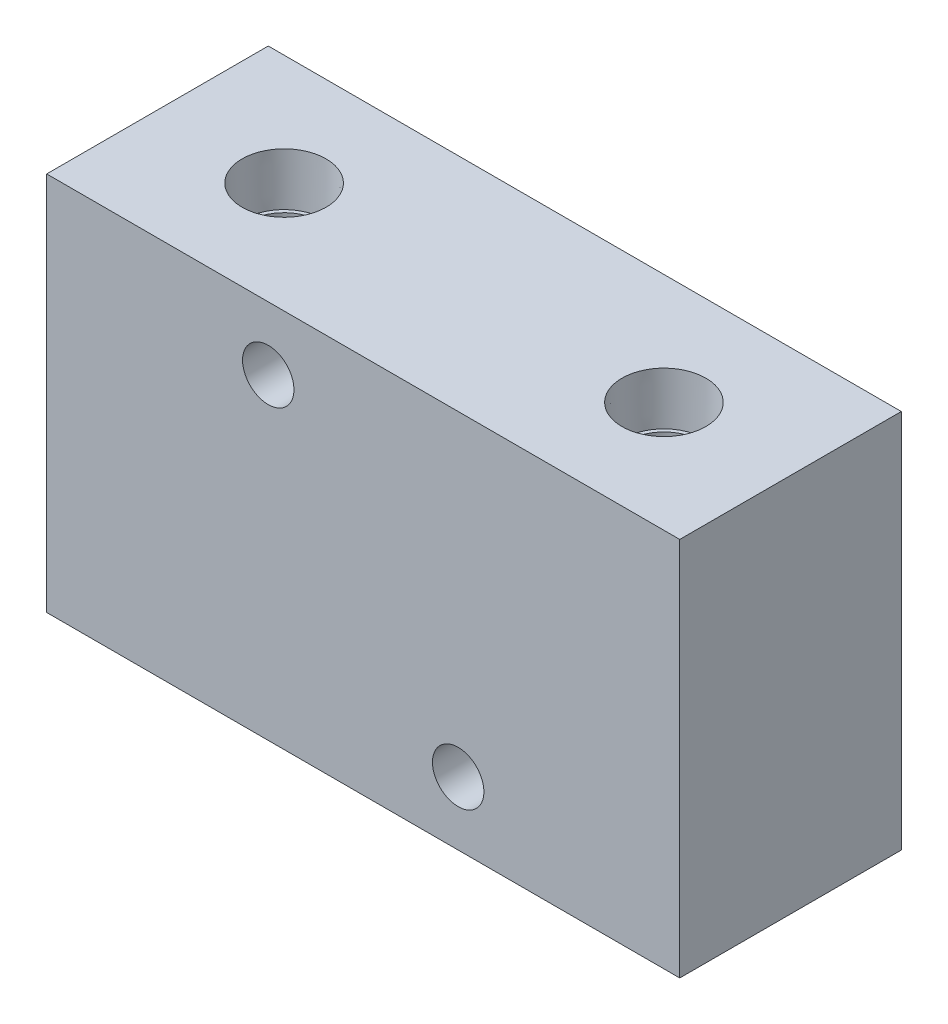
from build123d import *

# Parameters (mm, degrees)
SKETCH1_W                = 127
SKETCH1_H                = 76.2
BASE_EXTRUDE_DEPTH       = 44.45
SKETCH13_R               = 10.47242
CUT_EXTRUDE7_DEPTH       = 13.57122
CUT_EXTRUDE7_DRAFT       = -1.783333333
SKETCH14_R               = 8.9281
CUT_EXTRUDE8_DEPTH       = 114.3
SKETCH17_R               = 8.41883
CUT_EXTRUDE10_DEPTH      = 10.33018
CUT_EXTRUDE10_DRAFT      = -1.783333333
CUT_EXTRUDE11_REACH      = 182.583
CUT_EXTRUDE11_END_RADIUS = 8.9281
SKETCH18_R               = 7.3406
SKETCH21_R               = 8.41883
CUT_EXTRUDE13_DEPTH      = 10.33018
CUT_EXTRUDE13_DRAFT      = -1.783333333
CUT_EXTRUDE14_REACH      = 151.643
CUT_EXTRUDE14_END_RADIUS = 8.9281
SKETCH22_R               = 7.3406
SKETCH25_R               = 8.41883
CUT_EXTRUDE16_DEPTH      = 10.3378
CUT_EXTRUDE16_DRAFT      = -1.783333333
CUT_EXTRUDE17_REACH      = 124.053
CUT_EXTRUDE17_END_RADIUS = 8.9281
SKETCH26_R               = 7.3406
MIRROR1_COPY_1_SKETCH_R  = 8.41883
MIRROR1_COPY_1_DEPTH     = 10.33018
MIRROR1_COPY_1_DRAFT     = -1.783333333
MIRROR1_COPY_2_SKETCH_R  = 8.41883
MIRROR1_COPY_2_DEPTH     = 10.3378
MIRROR1_COPY_2_DRAFT     = -1.783333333
SKETCH29_R               = 5.1562
CUT_EXTRUDE19_DEPTH      = 87.36933773


with BuildPart() as part:
    # Sketch1 → Base-Extrude (new body)
    with BuildSketch(Plane.XY):
        Rectangle(SKETCH1_W, SKETCH1_H)
    extrude(amount=BASE_EXTRUDE_DEPTH)


with BuildPart() as cut_extrude7_tool:
    # Sketch13 → Cut-Extrude7 (with draft: the straight prism first)
    with BuildSketch(Plane(origin=(-63.5, 42.382338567, -29.074180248), x_dir=(0, 0, 1), z_dir=(-1, 0, 0))):
        with Locations((51.173800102, -42.382338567)):
            Circle(SKETCH13_R)
    extrude(amount=-CUT_EXTRUDE7_DEPTH)
    # Cut-Extrude7: the draft: its side faces are tilted about the plane it starts from
    cut_extrude7_sides = [cut_extrude7_tool.faces().sort_by_distance(p)[0] for p in [
        (-56.71439, 0, 11.627199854),
    ]]
    draft(cut_extrude7_sides, Plane(origin=(-63.5, 42.382338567, -29.074180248), x_dir=(0, 0, 1), z_dir=(-1, 0, 0)), CUT_EXTRUDE7_DRAFT)


with BuildPart() as part_1:
    add(part.part)

    # Cut-Extrude7: cut by cut_extrude7_tool
    add(cut_extrude7_tool.part, mode=Mode.SUBTRACT)

    # Sketch14 → Cut-Extrude8 (cut)
    with BuildSketch(Plane(origin=(-63.5, 38.1, -63.5), x_dir=(0, 0, 1), z_dir=(-1, 0, 0))):
        with Locations((85.599619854, -38.1)):
            Circle(SKETCH14_R)
    extrude(amount=-CUT_EXTRUDE8_DEPTH, mode=Mode.SUBTRACT)

    # Cut-Extrude9 cone 1 section (on through the dimple's axis) → Cut-Extrude9 (revolve, cut)
    with BuildSketch(Plane(origin=(50.8, 0, 22.099619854), x_dir=(0, 0, 1), z_dir=(0, 1, 0))):
        Polygon((0, 0), (8.9281, 0), (0, 5.154640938), align=None)
    revolve(axis=Axis((50.8, 0, 22.099619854), (1, 0, 0)), mode=Mode.SUBTRACT)


with BuildPart() as cut_extrude10_tool:
    # Sketch17 → Cut-Extrude10 (with draft: the straight prism first)
    with BuildSketch(Plane(origin=(97.86363054, -38.1, 25.99710819), x_dir=(1, 0, 0), z_dir=(0, -1, 0))):
        with Locations((-59.76363054, -3.77210819)):
            Circle(SKETCH17_R)
    extrude(amount=-CUT_EXTRUDE10_DEPTH)
    # Cut-Extrude10: the draft: its side faces are tilted about the plane it starts from
    cut_extrude10_sides = [cut_extrude10_tool.faces().sort_by_distance(p)[0] for p in [
        (29.68117, -32.93491, 22.225),
    ]]
    draft(cut_extrude10_sides, Plane(origin=(97.86363054, -38.1, 25.99710819), x_dir=(1, 0, 0), z_dir=(0, -1, 0)), CUT_EXTRUDE10_DRAFT)


with BuildPart() as part_2:
    add(part_1.part)

    # Cut-Extrude10: cut by cut_extrude10_tool
    add(cut_extrude10_tool.part, mode=Mode.SUBTRACT)

    # Cut-Extrude11: up to this cylinder (the profile starts outside it)
    cut_extrude11_end = Plane(origin=(38.1, 0, 22.099619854), z_dir=(-1, 0, 0)) * Cylinder(CUT_EXTRUDE11_END_RADIUS, 384.0222, mode=Mode.PRIVATE)
    # Sketch18 → Cut-Extrude11 (cut, up to the surface)
    with BuildSketch(Plane(origin=(98.70252821, -38.1, 22.225), x_dir=(1, 0, 0), z_dir=(0, -1, 0)), mode=Mode.PRIVATE) as cut_extrude11_sk1:
        with Locations(Location((-60.60252821, 0, 0), (0, 0, 270))):
            Circle(SKETCH18_R)
    cut_extrude11_tool1 = extrude(cut_extrude11_sk1.sketch, amount=-CUT_EXTRUDE11_REACH, mode=Mode.PRIVATE) - cut_extrude11_end
    cut_extrude11 = cut_extrude11_tool1.solids().sort_by_distance((38.1, -38.1, 22.225))[0]
    add(cut_extrude11, mode=Mode.SUBTRACT)


with BuildPart() as cut_extrude13_tool:
    # Sketch21 → Cut-Extrude13 (with draft: the straight prism first)
    with BuildSketch(Plane(origin=(60.495960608, -38.1, 35.437611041), x_dir=(1, 0, 0), z_dir=(0, -1, 0))):
        with Locations((-60.495960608, -13.212611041)):
            Circle(SKETCH21_R)
    extrude(amount=-CUT_EXTRUDE13_DEPTH)
    # Cut-Extrude13: the draft: its side faces are tilted about the plane it starts from
    cut_extrude13_sides = [cut_extrude13_tool.faces().sort_by_distance(p)[0] for p in [
        (-8.41883, -32.93491, 22.225),
    ]]
    draft(cut_extrude13_sides, Plane(origin=(60.495960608, -38.1, 35.437611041), x_dir=(1, 0, 0), z_dir=(0, -1, 0)), CUT_EXTRUDE13_DRAFT)


with BuildPart() as part_3:
    add(part_2.part)

    # Cut-Extrude13: cut by cut_extrude13_tool
    add(cut_extrude13_tool.part, mode=Mode.SUBTRACT)

    # Cut-Extrude14: up to this cylinder (the profile starts outside it)
    cut_extrude14_end = Plane(origin=(0, 0, 22.099619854), z_dir=(-1, 0, 0)) * Cylinder(CUT_EXTRUDE14_END_RADIUS, 322.1422, mode=Mode.PRIVATE)
    # Sketch22 → Cut-Extrude14 (cut, up to the surface)
    with BuildSketch(Plane(origin=(61.334858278, -38.1, 31.665502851), x_dir=(1, 0, 0), z_dir=(0, -1, 0)), mode=Mode.PRIVATE) as cut_extrude14_sk1:
        with Locations(Location((-61.334858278, -9.440502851, 0), (0, 0, 270))):
            Circle(SKETCH22_R)
    cut_extrude14_tool1 = extrude(cut_extrude14_sk1.sketch, amount=-CUT_EXTRUDE14_REACH, mode=Mode.PRIVATE) - cut_extrude14_end
    add(cut_extrude14_tool1.solids().sort_by_distance((0, -38.1, 22.225))[0], mode=Mode.SUBTRACT)


with BuildPart() as cut_extrude16_tool:
    # Sketch25 → Cut-Extrude16 (with draft: the straight prism first)
    with BuildSketch(Plane(origin=(25.307359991, -38.1, 36.236677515), x_dir=(1, 0, 0), z_dir=(0, -1, 0))):
        with Locations((-63.407359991, -14.011677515)):
            Circle(SKETCH25_R)
    extrude(amount=-CUT_EXTRUDE16_DEPTH)
    # Cut-Extrude16: the draft: its side faces are tilted about the plane it starts from
    cut_extrude16_sides = [cut_extrude16_tool.faces().sort_by_distance(p)[0] for p in [
        (-46.51883, -32.9311, 22.225),
    ]]
    draft(cut_extrude16_sides, Plane(origin=(25.307359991, -38.1, 36.236677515), x_dir=(1, 0, 0), z_dir=(0, -1, 0)), CUT_EXTRUDE16_DRAFT)


with BuildPart() as part_4:
    add(part_3.part)

    # Cut-Extrude16: cut by cut_extrude16_tool
    add(cut_extrude16_tool.part, mode=Mode.SUBTRACT)

    # Cut-Extrude17: up to this cylinder (the profile starts outside it)
    cut_extrude17_end = Plane(origin=(-38.1, 0, 22.099619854), z_dir=(-1, 0, 0)) * Cylinder(CUT_EXTRUDE17_END_RADIUS, 266.9622, mode=Mode.PRIVATE)
    # Sketch26 → Cut-Extrude17 (cut, up to the surface)
    with BuildSketch(Plane(origin=(26.146257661, -38.1, 32.464569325), x_dir=(1, 0, 0), z_dir=(0, -1, 0)), mode=Mode.PRIVATE) as cut_extrude17_sk1:
        with Locations(Location((-64.246257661, -10.239569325, 0), (0, 0, 270))):
            Circle(SKETCH26_R)
    cut_extrude17_tool1 = extrude(cut_extrude17_sk1.sketch, amount=-CUT_EXTRUDE17_REACH, mode=Mode.PRIVATE) - cut_extrude17_end
    cut_extrude17 = cut_extrude17_tool1.solids().sort_by_distance((-38.1, -38.1, 22.225))[0]
    add(cut_extrude17, mode=Mode.SUBTRACT)

    # Mirror1: Cut-Extrude11, Cut-Extrude17 across plane
    add(cut_extrude11.mirror(Plane.ZX), mode=Mode.SUBTRACT)
    add(cut_extrude17.mirror(Plane.ZX), mode=Mode.SUBTRACT)


with BuildPart() as mirror1_copy_1_tool:
    # Mirror1 copy 1 sketch → Mirror1 copy 1 (with draft: the straight prism first)
    with BuildSketch(Plane(origin=(97.86363054, 38.1, 25.99710819), x_dir=(1, 0, 0), z_dir=(0, 1, 0))):
        with Locations((-59.76363054, 3.77210819)):
            Circle(MIRROR1_COPY_1_SKETCH_R)
    extrude(amount=-MIRROR1_COPY_1_DEPTH)
    # Mirror1 copy 1: the draft: its side faces are tilted about the plane it starts from
    mirror1_copy_1_sides = [mirror1_copy_1_tool.faces().sort_by_distance(p)[0] for p in [
        (29.68117, 32.93491, 22.225),
    ]]
    draft(mirror1_copy_1_sides, Plane(origin=(97.86363054, 38.1, 25.99710819), x_dir=(1, 0, 0), z_dir=(0, 1, 0)), MIRROR1_COPY_1_DRAFT)


with BuildPart() as part_5:
    add(part_4.part)

    # Mirror1 copy 1: cut by mirror1_copy_1_tool
    add(mirror1_copy_1_tool.part, mode=Mode.SUBTRACT)


with BuildPart() as mirror1_copy_2_tool:
    # Mirror1 copy 2 sketch → Mirror1 copy 2 (with draft: the straight prism first)
    with BuildSketch(Plane(origin=(25.307359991, 38.1, 36.236677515), x_dir=(1, 0, 0), z_dir=(0, 1, 0))):
        with Locations((-63.407359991, 14.011677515)):
            Circle(MIRROR1_COPY_2_SKETCH_R)
    extrude(amount=-MIRROR1_COPY_2_DEPTH)
    # Mirror1 copy 2: the draft: its side faces are tilted about the plane it starts from
    mirror1_copy_2_sides = [mirror1_copy_2_tool.faces().sort_by_distance(p)[0] for p in [
        (-46.51883, 32.9311, 22.225),
    ]]
    draft(mirror1_copy_2_sides, Plane(origin=(25.307359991, 38.1, 36.236677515), x_dir=(1, 0, 0), z_dir=(0, 1, 0)), MIRROR1_COPY_2_DRAFT)


with BuildPart() as part_6:
    add(part_5.part)

    # Mirror1 copy 2: cut by mirror1_copy_2_tool
    add(mirror1_copy_2_tool.part, mode=Mode.SUBTRACT)

    # Sketch29 → Cut-Extrude19 (cut, through all)
    with BuildSketch(Plane(origin=(0, 0, 0), x_dir=(-1, 0, 0), z_dir=(0, 0, -1))):
        with Locations((-19.05, -25.4)):
            Circle(SKETCH29_R)
        with Locations((19.05, 25.4)):
            Circle(SKETCH29_R)
    extrude(amount=-CUT_EXTRUDE19_DEPTH, mode=Mode.SUBTRACT)


solid = part_6.part
